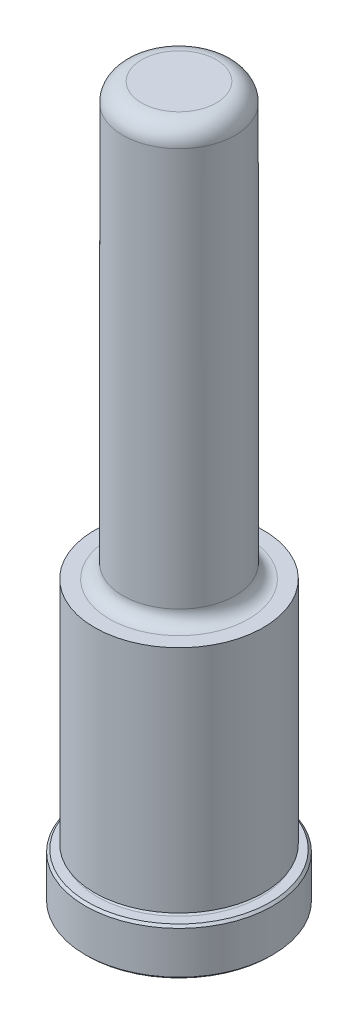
from build123d import *

# Parameters (mm, degrees)
CHAMFER1_SIZE = 0.381
FILLET1_R     = 3.175


with BuildPart() as part:
    # Sketch1 → Revolve1 (revolve)
    with BuildSketch(Plane(origin=(0, 0, 0), x_dir=(0, 0, -1), z_dir=(1, 0, 0)), mode=Mode.PRIVATE) as revolve1_sk:
        with BuildLine():
            Line((0, 0), (15.875, 0))
            Line((15.875, 0), (15.875, 7.9248))
            Line((15.875, 7.9248), (13.8938, 7.9248))
            ThreePointArc((13.8938, 7.9248), (13.5128, 8.3058), (13.8938, 8.6868))
            Line((13.8938, 8.6868), (14.3002, 8.6868))
            Line((14.3002, 8.6868), (14.3002, 47.625))
            Line((14.3002, 47.625), (11.7983, 47.625))
            ThreePointArc((11.7983, 47.625), (10.181853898, 48.294553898), (9.5123, 49.911))
            Line((9.5123, 49.911), (9.5123, 120.65))
            Line((9.5123, 120.65), (0, 120.65))
            Line((0, 120.65), (0, 0))
        make_face()
    revolve(revolve1_sk.sketch.rotate(Axis((0, 0, 0), (0, -1, 0)), 180), axis=Axis((0, 0, 0), (0, -1, 0)))

    # Chamfer1
    chamfer1_edges = [part.edges().sort_by_distance(p)[0] for p in [
        (0, 7.9248, -15.875),
        (0, 0, -15.875),
    ]]
    chamfer(chamfer1_edges, length=CHAMFER1_SIZE)

    # Fillet1
    fillet1_edges = [part.edges().sort_by_distance(p)[0] for p in [
        (0, 120.65, -9.5123),
    ]]
    fillet(fillet1_edges, radius=FILLET1_R)


solid = part.part
